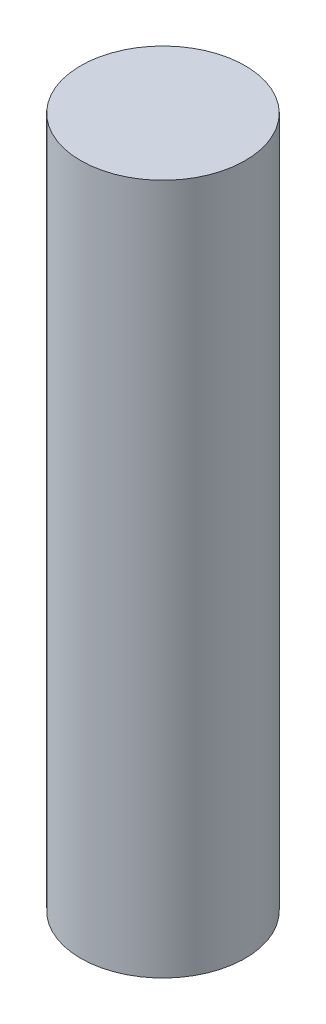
ISO-10303-21;
HEADER;
FILE_DESCRIPTION(('STEP AP214'),'2;1');
FILE_NAME('part.step','',(''),(''),'','','');
FILE_SCHEMA(('AUTOMOTIVE_DESIGN { 1 0 10303 214 1 1 1 1 }'));
ENDSEC;
DATA;
#1=APPLICATION_CONTEXT('core data for automotive mechanical design processes');
#2=APPLICATION_PROTOCOL_DEFINITION('international standard','automotive_design',2000,#1);
#3=PRODUCT_CONTEXT('',#1,'mechanical');
#4=PRODUCT('Part','Part','',(#3));
#5=PRODUCT_RELATED_PRODUCT_CATEGORY('part','',(#4));
#6=PRODUCT_DEFINITION_FORMATION('','',#4);
#7=PRODUCT_DEFINITION_CONTEXT('part definition',#1,'design');
#8=PRODUCT_DEFINITION('design','',#6,#7);
#9=PRODUCT_DEFINITION_SHAPE('','',#8);
#10=(LENGTH_UNIT() NAMED_UNIT(*) SI_UNIT(.MILLI.,.METRE.));
#11=(NAMED_UNIT(*) PLANE_ANGLE_UNIT() SI_UNIT($,.RADIAN.));
#12=(NAMED_UNIT(*) SI_UNIT($,.STERADIAN.) SOLID_ANGLE_UNIT());
#13=UNCERTAINTY_MEASURE_WITH_UNIT(LENGTH_MEASURE(1.E-05),#10,'distance_accuracy_value','');
#14=(GEOMETRIC_REPRESENTATION_CONTEXT(3) GLOBAL_UNCERTAINTY_ASSIGNED_CONTEXT((#13)) GLOBAL_UNIT_ASSIGNED_CONTEXT((#10,
#11,#12)) REPRESENTATION_CONTEXT('',''));
#15=CARTESIAN_POINT('',(0.,0.,0.));
#16=DIRECTION('',(0.,0.,1.));
#17=DIRECTION('',(1.,0.,0.));
#18=AXIS2_PLACEMENT_3D('',#15,#16,#17);
#19=CARTESIAN_POINT('',(0.,53.34,0.));
#20=DIRECTION('',(0.,-1.,0.));
#21=DIRECTION('',(0.,0.,-1.));
#22=AXIS2_PLACEMENT_3D('',#19,#20,#21);
#23=CYLINDRICAL_SURFACE('',#22,6.35);
#24=CARTESIAN_POINT('',(0.,53.34,0.));
#25=DIRECTION('',(0.,1.,0.));
#26=DIRECTION('',(0.,0.,1.));
#27=AXIS2_PLACEMENT_3D('',#24,#25,#26);
#28=CIRCLE('',#27,6.35);
#29=CARTESIAN_POINT('',(0.,53.34,6.35));
#30=VERTEX_POINT('',#29);
#31=EDGE_CURVE('E10',#30,#30,#28,.T.);
#32=ORIENTED_EDGE('',*,*,#31,.F.);
#33=EDGE_LOOP('',(#32));
#34=FACE_BOUND('',#33,.T.);
#35=CARTESIAN_POINT('',(0.,0.,0.));
#36=DIRECTION('',(0.,1.,0.));
#37=DIRECTION('',(0.,0.,1.));
#38=AXIS2_PLACEMENT_3D('',#35,#36,#37);
#39=CIRCLE('',#38,6.35);
#40=CARTESIAN_POINT('',(0.,0.,6.35));
#41=VERTEX_POINT('',#40);
#42=EDGE_CURVE('E34',#41,#41,#39,.T.);
#43=ORIENTED_EDGE('',*,*,#42,.T.);
#44=EDGE_LOOP('',(#43));
#45=FACE_BOUND('',#44,.T.);
#46=ADVANCED_FACE('F31',(#34,#45),#23,.T.);
#47=CARTESIAN_POINT('',(0.,53.34,0.));
#48=DIRECTION('',(0.,1.,0.));
#49=DIRECTION('',(0.,0.,1.));
#50=AXIS2_PLACEMENT_3D('',#47,#48,#49);
#51=PLANE('',#50);
#52=ORIENTED_EDGE('',*,*,#31,.T.);
#53=EDGE_LOOP('',(#52));
#54=FACE_BOUND('',#53,.T.);
#55=ADVANCED_FACE('F46',(#54),#51,.T.);
#56=CARTESIAN_POINT('',(0.,0.,0.));
#57=DIRECTION('',(0.,1.,0.));
#58=DIRECTION('',(0.,0.,1.));
#59=AXIS2_PLACEMENT_3D('',#56,#57,#58);
#60=PLANE('',#59);
#61=ORIENTED_EDGE('',*,*,#42,.F.);
#62=EDGE_LOOP('',(#61));
#63=FACE_BOUND('',#62,.T.);
#64=ADVANCED_FACE('F44',(#63),#60,.F.);
#65=CLOSED_SHELL('',(#46,#55,#64));
#66=MANIFOLD_SOLID_BREP('B2',#65);
#67=ADVANCED_BREP_SHAPE_REPRESENTATION('',(#18,#66),#14);
#68=SHAPE_DEFINITION_REPRESENTATION(#9,#67);
ENDSEC;
END-ISO-10303-21;
